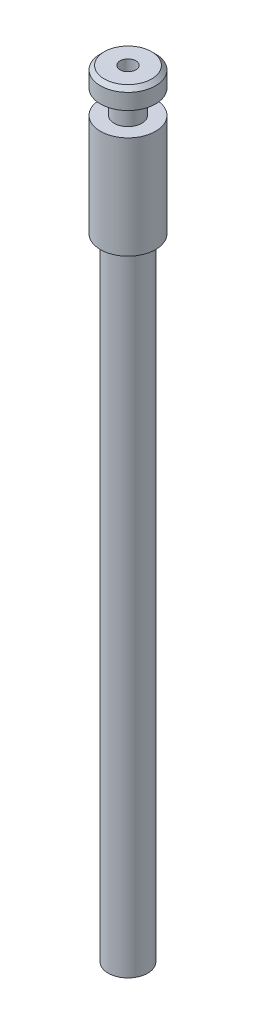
from build123d import *

# Parameters (mm, degrees)
ESQUISSE1_R             = 3.5
BOSS_EXTRU_1_DEPTH      = 2.5
CHANFREIN1_SIZE         = 0.5
ESQUISSE2_R             = 1.75
BOSS_EXTRU_2_DEPTH      = 3
BOSS_EXTRU_3_START      = 13
ESQUISSE3_R             = 3.5
BOSS_EXTRU_3_DEPTH      = 13
ESQUISSE6_R             = 2.5
BOSS_EXTRU_5_DEPTH      = 80
ESQUISSE4_R             = 1
ENL_V_MAT_EXTRU_2_DEPTH = 99.62428707


with BuildPart() as part:
    # Esquisse1 → Boss.-Extru.1 (new body)
    with BuildSketch(Plane(origin=(0, 0, 0), x_dir=(1, 0, 0), z_dir=(0, 1, 0))):
        with Locations(Location((0, 0, 0), (0, 0, 270))):
            Circle(ESQUISSE1_R)
    extrude(amount=BOSS_EXTRU_1_DEPTH)

    # Chanfrein1
    chanfrein1_edges = [part.edges().sort_by_distance(p)[0] for p in [
        (0, 2.5, -3.5),
    ]]
    chamfer(chanfrein1_edges, length=CHANFREIN1_SIZE)

    # Esquisse2 → Boss.-Extru.2 (add)
    with BuildSketch(Plane.XZ):
        with Locations(Location((0, 0, 0), (0, 0, 90))):
            Circle(ESQUISSE2_R)
    extrude(amount=BOSS_EXTRU_2_DEPTH)

    # Esquisse3 → Boss.-Extru.3 (add)
    with BuildSketch(Plane.XZ.offset(3).offset(BOSS_EXTRU_3_START)):
        with Locations(Location((0, 0, 0), (0, 0, 90))):
            Circle(ESQUISSE3_R)
    extrude(amount=-BOSS_EXTRU_3_DEPTH)

    # Esquisse6 → Boss.-Extru.5 (add)
    with BuildSketch(Plane.XZ.offset(16)):
        with Locations(Location((0, 0, 0), (0, 0, 270))):
            Circle(ESQUISSE6_R)
    extrude(amount=BOSS_EXTRU_5_DEPTH)

    # Esquisse4 → Enl_v. mat.-Extru.2 (cut, through all)
    with BuildSketch(Plane(origin=(0, 2.5, 0), x_dir=(1, 0, 0), z_dir=(0, 1, 0))):
        with Locations(Location((0, 0, 0), (0, 0, 270))):
            Circle(ESQUISSE4_R)
    extrude(amount=-ENL_V_MAT_EXTRU_2_DEPTH, mode=Mode.SUBTRACT)


solid = part.part
